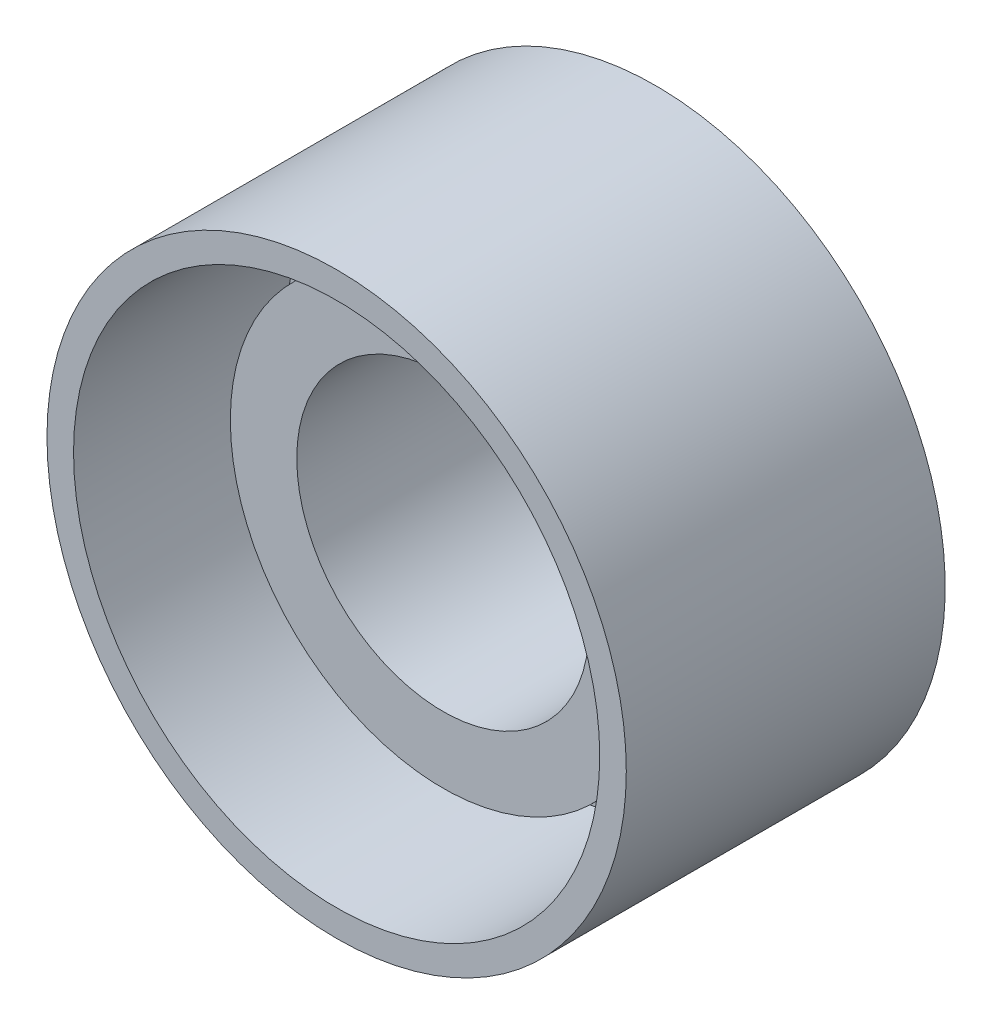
ISO-10303-21;
HEADER;
FILE_DESCRIPTION(('STEP AP214'),'2;1');
FILE_NAME('part.step','',(''),(''),'','','');
FILE_SCHEMA(('AUTOMOTIVE_DESIGN { 1 0 10303 214 1 1 1 1 }'));
ENDSEC;
DATA;
#1=APPLICATION_CONTEXT('core data for automotive mechanical design processes');
#2=APPLICATION_PROTOCOL_DEFINITION('international standard','automotive_design',2000,#1);
#3=PRODUCT_CONTEXT('',#1,'mechanical');
#4=PRODUCT('Part','Part','',(#3));
#5=PRODUCT_RELATED_PRODUCT_CATEGORY('part','',(#4));
#6=PRODUCT_DEFINITION_FORMATION('','',#4);
#7=PRODUCT_DEFINITION_CONTEXT('part definition',#1,'design');
#8=PRODUCT_DEFINITION('design','',#6,#7);
#9=PRODUCT_DEFINITION_SHAPE('','',#8);
#10=(LENGTH_UNIT() NAMED_UNIT(*) SI_UNIT(.MILLI.,.METRE.));
#11=(NAMED_UNIT(*) PLANE_ANGLE_UNIT() SI_UNIT($,.RADIAN.));
#12=(NAMED_UNIT(*) SI_UNIT($,.STERADIAN.) SOLID_ANGLE_UNIT());
#13=UNCERTAINTY_MEASURE_WITH_UNIT(LENGTH_MEASURE(1.E-05),#10,'distance_accuracy_value','');
#14=(GEOMETRIC_REPRESENTATION_CONTEXT(3) GLOBAL_UNCERTAINTY_ASSIGNED_CONTEXT((#13)) GLOBAL_UNIT_ASSIGNED_CONTEXT((#10,
#11,#12)) REPRESENTATION_CONTEXT('',''));
#15=CARTESIAN_POINT('',(0.,0.,0.));
#16=DIRECTION('',(0.,0.,1.));
#17=DIRECTION('',(1.,0.,0.));
#18=AXIS2_PLACEMENT_3D('',#15,#16,#17);
#19=CARTESIAN_POINT('',(0.,0.,0.));
#20=DIRECTION('',(0.,0.,-1.));
#21=DIRECTION('',(-1.,0.,0.));
#22=AXIS2_PLACEMENT_3D('',#19,#20,#21);
#23=PLANE('',#22);
#24=CARTESIAN_POINT('',(0.,0.,0.));
#25=DIRECTION('',(0.,0.,1.));
#26=DIRECTION('',(1.,0.,0.));
#27=AXIS2_PLACEMENT_3D('',#24,#25,#26);
#28=CIRCLE('',#27,49.5);
#29=CARTESIAN_POINT('',(49.5,0.,0.));
#30=VERTEX_POINT('',#29);
#31=EDGE_CURVE('E54',#30,#30,#28,.T.);
#32=ORIENTED_EDGE('',*,*,#31,.T.);
#33=EDGE_LOOP('',(#32));
#34=FACE_BOUND('',#33,.T.);
#35=CARTESIAN_POINT('',(0.,0.,0.));
#36=DIRECTION('',(0.,0.,-1.));
#37=DIRECTION('',(-1.,0.,0.));
#38=AXIS2_PLACEMENT_3D('',#35,#36,#37);
#39=CIRCLE('',#38,40.);
#40=CARTESIAN_POINT('',(-40.,0.,0.));
#41=VERTEX_POINT('',#40);
#42=EDGE_CURVE('E10',#41,#41,#39,.F.);
#43=ORIENTED_EDGE('',*,*,#42,.F.);
#44=EDGE_LOOP('',(#43));
#45=FACE_BOUND('',#44,.T.);
#46=ADVANCED_FACE('F37',(#34,#45),#23,.F.);
#47=CARTESIAN_POINT('',(0.,0.,40.));
#48=DIRECTION('',(0.,0.,1.));
#49=DIRECTION('',(1.,0.,0.));
#50=AXIS2_PLACEMENT_3D('',#47,#48,#49);
#51=PLANE('',#50);
#52=CARTESIAN_POINT('',(0.,0.,40.));
#53=DIRECTION('',(0.,0.,1.));
#54=DIRECTION('',(1.,0.,0.));
#55=AXIS2_PLACEMENT_3D('',#52,#53,#54);
#56=CIRCLE('',#55,54.5);
#57=CARTESIAN_POINT('',(54.5,0.,40.));
#58=VERTEX_POINT('',#57);
#59=EDGE_CURVE('E45',#58,#58,#56,.T.);
#60=ORIENTED_EDGE('',*,*,#59,.T.);
#61=EDGE_LOOP('',(#60));
#62=FACE_BOUND('',#61,.T.);
#63=CARTESIAN_POINT('',(0.,0.,40.));
#64=DIRECTION('',(0.,0.,1.));
#65=DIRECTION('',(1.,0.,0.));
#66=AXIS2_PLACEMENT_3D('',#63,#64,#65);
#67=CIRCLE('',#66,49.5);
#68=CARTESIAN_POINT('',(49.5,0.,40.));
#69=VERTEX_POINT('',#68);
#70=EDGE_CURVE('E49',#69,#69,#67,.T.);
#71=ORIENTED_EDGE('',*,*,#70,.F.);
#72=EDGE_LOOP('',(#71));
#73=FACE_BOUND('',#72,.T.);
#74=ADVANCED_FACE('F91',(#62,#73),#51,.T.);
#75=CARTESIAN_POINT('',(0.,0.,40.));
#76=DIRECTION('',(0.,0.,-1.));
#77=DIRECTION('',(-1.,0.,0.));
#78=AXIS2_PLACEMENT_3D('',#75,#76,#77);
#79=CYLINDRICAL_SURFACE('',#78,54.5);
#80=ORIENTED_EDGE('',*,*,#59,.F.);
#81=EDGE_LOOP('',(#80));
#82=FACE_BOUND('',#81,.T.);
#83=CARTESIAN_POINT('',(0.,0.,-20.));
#84=DIRECTION('',(0.,0.,-1.));
#85=DIRECTION('',(-1.,0.,0.));
#86=AXIS2_PLACEMENT_3D('',#83,#84,#85);
#87=CIRCLE('',#86,54.5);
#88=CARTESIAN_POINT('',(-54.5,0.,-20.));
#89=VERTEX_POINT('',#88);
#90=EDGE_CURVE('E57',#89,#89,#87,.T.);
#91=ORIENTED_EDGE('',*,*,#90,.F.);
#92=EDGE_LOOP('',(#91));
#93=FACE_BOUND('',#92,.T.);
#94=ADVANCED_FACE('F39',(#82,#93),#79,.T.);
#95=CARTESIAN_POINT('',(0.,0.,40.));
#96=DIRECTION('',(0.,0.,-1.));
#97=DIRECTION('',(-1.,0.,0.));
#98=AXIS2_PLACEMENT_3D('',#95,#96,#97);
#99=CYLINDRICAL_SURFACE('',#98,49.5);
#100=ORIENTED_EDGE('',*,*,#70,.T.);
#101=EDGE_LOOP('',(#100));
#102=FACE_BOUND('',#101,.T.);
#103=ORIENTED_EDGE('',*,*,#31,.F.);
#104=EDGE_LOOP('',(#103));
#105=FACE_BOUND('',#104,.T.);
#106=ADVANCED_FACE('F86',(#102,#105),#99,.F.);
#107=CARTESIAN_POINT('',(0.,0.,-20.));
#108=DIRECTION('',(0.,0.,-1.));
#109=DIRECTION('',(-1.,0.,0.));
#110=AXIS2_PLACEMENT_3D('',#107,#108,#109);
#111=PLANE('',#110);
#112=CARTESIAN_POINT('',(0.,0.,-20.));
#113=DIRECTION('',(0.,0.,-1.));
#114=DIRECTION('',(-1.,0.,0.));
#115=AXIS2_PLACEMENT_3D('',#112,#113,#114);
#116=CIRCLE('',#115,27.5);
#117=CARTESIAN_POINT('',(-27.5,0.,-20.));
#118=VERTEX_POINT('',#117);
#119=EDGE_CURVE('E63',#118,#118,#116,.T.);
#120=ORIENTED_EDGE('',*,*,#119,.F.);
#121=EDGE_LOOP('',(#120));
#122=FACE_BOUND('',#121,.T.);
#123=ORIENTED_EDGE('',*,*,#90,.T.);
#124=EDGE_LOOP('',(#123));
#125=FACE_BOUND('',#124,.T.);
#126=ADVANCED_FACE('F80',(#122,#125),#111,.T.);
#127=CARTESIAN_POINT('',(0.,0.,20.));
#128=DIRECTION('',(0.,0.,-1.));
#129=DIRECTION('',(-1.,0.,0.));
#130=AXIS2_PLACEMENT_3D('',#127,#128,#129);
#131=CYLINDRICAL_SURFACE('',#130,40.);
#132=CARTESIAN_POINT('',(0.,0.,20.));
#133=DIRECTION('',(0.,0.,1.));
#134=DIRECTION('',(1.,0.,0.));
#135=AXIS2_PLACEMENT_3D('',#132,#133,#134);
#136=CIRCLE('',#135,40.);
#137=CARTESIAN_POINT('',(40.,0.,20.));
#138=VERTEX_POINT('',#137);
#139=EDGE_CURVE('E60',#138,#138,#136,.T.);
#140=ORIENTED_EDGE('',*,*,#139,.F.);
#141=EDGE_LOOP('',(#140));
#142=FACE_BOUND('',#141,.T.);
#143=ORIENTED_EDGE('',*,*,#42,.T.);
#144=EDGE_LOOP('',(#143));
#145=FACE_BOUND('',#144,.T.);
#146=ADVANCED_FACE('F75',(#142,#145),#131,.T.);
#147=CARTESIAN_POINT('',(0.,0.,20.));
#148=DIRECTION('',(0.,0.,1.));
#149=DIRECTION('',(1.,0.,0.));
#150=AXIS2_PLACEMENT_3D('',#147,#148,#149);
#151=PLANE('',#150);
#152=CARTESIAN_POINT('',(0.,0.,20.));
#153=DIRECTION('',(0.,0.,1.));
#154=DIRECTION('',(1.,0.,0.));
#155=AXIS2_PLACEMENT_3D('',#152,#153,#154);
#156=CIRCLE('',#155,27.5);
#157=CARTESIAN_POINT('',(27.5,0.,20.));
#158=VERTEX_POINT('',#157);
#159=EDGE_CURVE('E41',#158,#158,#156,.T.);
#160=ORIENTED_EDGE('',*,*,#159,.F.);
#161=EDGE_LOOP('',(#160));
#162=FACE_BOUND('',#161,.T.);
#163=ORIENTED_EDGE('',*,*,#139,.T.);
#164=EDGE_LOOP('',(#163));
#165=FACE_BOUND('',#164,.T.);
#166=ADVANCED_FACE('F72',(#162,#165),#151,.T.);
#167=CARTESIAN_POINT('',(0.,0.,40.));
#168=DIRECTION('',(0.,0.,-1.));
#169=DIRECTION('',(-1.,0.,0.));
#170=AXIS2_PLACEMENT_3D('',#167,#168,#169);
#171=CYLINDRICAL_SURFACE('',#170,27.5);
#172=ORIENTED_EDGE('',*,*,#159,.T.);
#173=EDGE_LOOP('',(#172));
#174=FACE_BOUND('',#173,.T.);
#175=ORIENTED_EDGE('',*,*,#119,.T.);
#176=EDGE_LOOP('',(#175));
#177=FACE_BOUND('',#176,.T.);
#178=ADVANCED_FACE('F70',(#174,#177),#171,.F.);
#179=CLOSED_SHELL('',(#46,#74,#94,#106,#126,#146,#166,#178));
#180=MANIFOLD_SOLID_BREP('B2',#179);
#181=ADVANCED_BREP_SHAPE_REPRESENTATION('',(#18,#180),#14);
#182=SHAPE_DEFINITION_REPRESENTATION(#9,#181);
ENDSEC;
END-ISO-10303-21;
